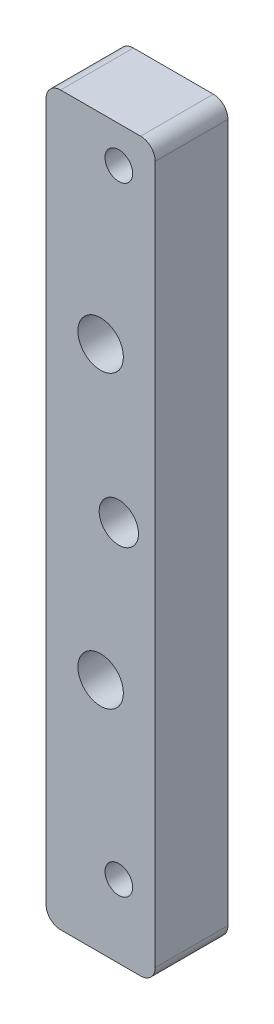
ISO-10303-21;
HEADER;
FILE_DESCRIPTION(('STEP AP214'),'2;1');
FILE_NAME('part.step','',(''),(''),'','','');
FILE_SCHEMA(('AUTOMOTIVE_DESIGN { 1 0 10303 214 1 1 1 1 }'));
ENDSEC;
DATA;
#1=APPLICATION_CONTEXT('core data for automotive mechanical design processes');
#2=APPLICATION_PROTOCOL_DEFINITION('international standard','automotive_design',2000,#1);
#3=PRODUCT_CONTEXT('',#1,'mechanical');
#4=PRODUCT('Part','Part','',(#3));
#5=PRODUCT_RELATED_PRODUCT_CATEGORY('part','',(#4));
#6=PRODUCT_DEFINITION_FORMATION('','',#4);
#7=PRODUCT_DEFINITION_CONTEXT('part definition',#1,'design');
#8=PRODUCT_DEFINITION('design','',#6,#7);
#9=PRODUCT_DEFINITION_SHAPE('','',#8);
#10=(LENGTH_UNIT() NAMED_UNIT(*) SI_UNIT(.MILLI.,.METRE.));
#11=(NAMED_UNIT(*) PLANE_ANGLE_UNIT() SI_UNIT($,.RADIAN.));
#12=(NAMED_UNIT(*) SI_UNIT($,.STERADIAN.) SOLID_ANGLE_UNIT());
#13=UNCERTAINTY_MEASURE_WITH_UNIT(LENGTH_MEASURE(1.E-05),#10,'distance_accuracy_value','');
#14=(GEOMETRIC_REPRESENTATION_CONTEXT(3) GLOBAL_UNCERTAINTY_ASSIGNED_CONTEXT((#13)) GLOBAL_UNIT_ASSIGNED_CONTEXT((#10,
#11,#12)) REPRESENTATION_CONTEXT('',''));
#15=CARTESIAN_POINT('',(0.,0.,0.));
#16=DIRECTION('',(0.,0.,1.));
#17=DIRECTION('',(1.,0.,0.));
#18=AXIS2_PLACEMENT_3D('',#15,#16,#17);
#19=CARTESIAN_POINT('',(-7.68933965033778,54.7924130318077,12.7));
#20=DIRECTION('',(1.,0.,0.));
#21=DIRECTION('',(0.,1.,0.));
#22=AXIS2_PLACEMENT_3D('',#19,#20,#21);
#23=PLANE('',#22);
#24=DIRECTION('',(0.,-1.,0.));
#25=VECTOR('',#24,1.);
#26=CARTESIAN_POINT('',(-7.68933965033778,54.7924130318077,0.));
#27=LINE('',#26,#25);
#28=CARTESIAN_POINT('',(-7.68933965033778,52.2524130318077,0.));
#29=VERTEX_POINT('',#28);
#30=CARTESIAN_POINT('',(-7.68933965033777,-69.6675869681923,0.));
#31=VERTEX_POINT('',#30);
#32=EDGE_CURVE('E140',#29,#31,#27,.T.);
#33=ORIENTED_EDGE('',*,*,#32,.T.);
#34=DIRECTION('',(0.,0.,-1.));
#35=VECTOR('',#34,1.);
#36=CARTESIAN_POINT('',(-7.68933965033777,-69.6675869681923,12.7));
#37=LINE('',#36,#35);
#38=CARTESIAN_POINT('',(-7.68933965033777,-69.6675869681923,12.7));
#39=VERTEX_POINT('',#38);
#40=EDGE_CURVE('E162',#31,#39,#37,.F.);
#41=ORIENTED_EDGE('',*,*,#40,.T.);
#42=DIRECTION('',(0.,-1.,0.));
#43=VECTOR('',#42,1.);
#44=CARTESIAN_POINT('',(-7.68933965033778,54.7924130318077,12.7));
#45=LINE('',#44,#43);
#46=CARTESIAN_POINT('',(-7.68933965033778,52.2524130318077,12.7));
#47=VERTEX_POINT('',#46);
#48=EDGE_CURVE('E138',#47,#39,#45,.T.);
#49=ORIENTED_EDGE('',*,*,#48,.F.);
#50=DIRECTION('',(0.,0.,-1.));
#51=VECTOR('',#50,1.);
#52=CARTESIAN_POINT('',(-7.68933965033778,52.2524130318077,12.7));
#53=LINE('',#52,#51);
#54=EDGE_CURVE('E159',#47,#29,#53,.T.);
#55=ORIENTED_EDGE('',*,*,#54,.T.);
#56=EDGE_LOOP('',(#33,#41,#49,#55));
#57=FACE_BOUND('',#56,.T.);
#58=ADVANCED_FACE('F43',(#57),#23,.F.);
#59=CARTESIAN_POINT('',(-7.68933965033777,-72.2075869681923,12.7));
#60=DIRECTION('',(0.,1.,0.));
#61=DIRECTION('',(0.,0.,1.));
#62=AXIS2_PLACEMENT_3D('',#59,#60,#61);
#63=PLANE('',#62);
#64=DIRECTION('',(1.,0.,0.));
#65=VECTOR('',#64,1.);
#66=CARTESIAN_POINT('',(-7.68933965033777,-72.2075869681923,0.));
#67=LINE('',#66,#65);
#68=CARTESIAN_POINT('',(-5.14933965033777,-72.2075869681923,0.));
#69=VERTEX_POINT('',#68);
#70=CARTESIAN_POINT('',(8.82066034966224,-72.2075869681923,0.));
#71=VERTEX_POINT('',#70);
#72=EDGE_CURVE('E136',#69,#71,#67,.T.);
#73=ORIENTED_EDGE('',*,*,#72,.T.);
#74=DIRECTION('',(0.,0.,-1.));
#75=VECTOR('',#74,1.);
#76=CARTESIAN_POINT('',(8.82066034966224,-72.2075869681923,12.7));
#77=LINE('',#76,#75);
#78=CARTESIAN_POINT('',(8.82066034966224,-72.2075869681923,12.7));
#79=VERTEX_POINT('',#78);
#80=EDGE_CURVE('E114',#71,#79,#77,.F.);
#81=ORIENTED_EDGE('',*,*,#80,.T.);
#82=DIRECTION('',(1.,0.,0.));
#83=VECTOR('',#82,1.);
#84=CARTESIAN_POINT('',(-7.68933965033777,-72.2075869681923,12.7));
#85=LINE('',#84,#83);
#86=CARTESIAN_POINT('',(-5.14933965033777,-72.2075869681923,12.7));
#87=VERTEX_POINT('',#86);
#88=EDGE_CURVE('E176',#87,#79,#85,.T.);
#89=ORIENTED_EDGE('',*,*,#88,.F.);
#90=DIRECTION('',(0.,0.,-1.));
#91=VECTOR('',#90,1.);
#92=CARTESIAN_POINT('',(-5.14933965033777,-72.2075869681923,12.7));
#93=LINE('',#92,#91);
#94=EDGE_CURVE('E119',#87,#69,#93,.T.);
#95=ORIENTED_EDGE('',*,*,#94,.T.);
#96=EDGE_LOOP('',(#73,#81,#89,#95));
#97=FACE_BOUND('',#96,.T.);
#98=ADVANCED_FACE('F181',(#97),#63,.F.);
#99=CARTESIAN_POINT('',(11.3606603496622,54.7924130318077,12.7));
#100=DIRECTION('',(-1.,0.,0.));
#101=DIRECTION('',(0.,-1.,0.));
#102=AXIS2_PLACEMENT_3D('',#99,#100,#101);
#103=PLANE('',#102);
#104=DIRECTION('',(0.,1.,0.));
#105=VECTOR('',#104,1.);
#106=CARTESIAN_POINT('',(11.3606603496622,54.7924130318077,12.7));
#107=LINE('',#106,#105);
#108=CARTESIAN_POINT('',(11.3606603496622,-69.6675869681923,12.7));
#109=VERTEX_POINT('',#108);
#110=CARTESIAN_POINT('',(11.3606603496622,52.2524130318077,12.7));
#111=VERTEX_POINT('',#110);
#112=EDGE_CURVE('E128',#109,#111,#107,.T.);
#113=ORIENTED_EDGE('',*,*,#112,.F.);
#114=DIRECTION('',(0.,0.,-1.));
#115=VECTOR('',#114,1.);
#116=CARTESIAN_POINT('',(11.3606603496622,-69.6675869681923,12.7));
#117=LINE('',#116,#115);
#118=CARTESIAN_POINT('',(11.3606603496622,-69.6675869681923,0.));
#119=VERTEX_POINT('',#118);
#120=EDGE_CURVE('E113',#109,#119,#117,.T.);
#121=ORIENTED_EDGE('',*,*,#120,.T.);
#122=DIRECTION('',(0.,1.,0.));
#123=VECTOR('',#122,1.);
#124=CARTESIAN_POINT('',(11.3606603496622,54.7924130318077,0.));
#125=LINE('',#124,#123);
#126=CARTESIAN_POINT('',(11.3606603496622,52.2524130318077,0.));
#127=VERTEX_POINT('',#126);
#128=EDGE_CURVE('E126',#119,#127,#125,.T.);
#129=ORIENTED_EDGE('',*,*,#128,.T.);
#130=DIRECTION('',(0.,0.,-1.));
#131=VECTOR('',#130,1.);
#132=CARTESIAN_POINT('',(11.3606603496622,52.2524130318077,12.7));
#133=LINE('',#132,#131);
#134=EDGE_CURVE('E130',#127,#111,#133,.F.);
#135=ORIENTED_EDGE('',*,*,#134,.T.);
#136=EDGE_LOOP('',(#113,#121,#129,#135));
#137=FACE_BOUND('',#136,.T.);
#138=ADVANCED_FACE('F125',(#137),#103,.F.);
#139=CARTESIAN_POINT('',(-7.68933965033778,54.7924130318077,12.7));
#140=DIRECTION('',(0.,-1.,0.));
#141=DIRECTION('',(0.,0.,-1.));
#142=AXIS2_PLACEMENT_3D('',#139,#140,#141);
#143=PLANE('',#142);
#144=DIRECTION('',(-1.,0.,0.));
#145=VECTOR('',#144,1.);
#146=CARTESIAN_POINT('',(-7.68933965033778,54.7924130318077,12.7));
#147=LINE('',#146,#145);
#148=CARTESIAN_POINT('',(8.82066034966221,54.7924130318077,12.7));
#149=VERTEX_POINT('',#148);
#150=CARTESIAN_POINT('',(-5.14933965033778,54.7924130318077,12.7));
#151=VERTEX_POINT('',#150);
#152=EDGE_CURVE('E144',#149,#151,#147,.T.);
#153=ORIENTED_EDGE('',*,*,#152,.F.);
#154=DIRECTION('',(0.,0.,-1.));
#155=VECTOR('',#154,1.);
#156=CARTESIAN_POINT('',(8.82066034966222,54.7924130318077,12.7));
#157=LINE('',#156,#155);
#158=CARTESIAN_POINT('',(8.82066034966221,54.7924130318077,0.));
#159=VERTEX_POINT('',#158);
#160=EDGE_CURVE('E13',#149,#159,#157,.T.);
#161=ORIENTED_EDGE('',*,*,#160,.T.);
#162=DIRECTION('',(-1.,0.,0.));
#163=VECTOR('',#162,1.);
#164=CARTESIAN_POINT('',(-7.68933965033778,54.7924130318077,0.));
#165=LINE('',#164,#163);
#166=CARTESIAN_POINT('',(-5.14933965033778,54.7924130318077,0.));
#167=VERTEX_POINT('',#166);
#168=EDGE_CURVE('E135',#159,#167,#165,.T.);
#169=ORIENTED_EDGE('',*,*,#168,.T.);
#170=DIRECTION('',(0.,0.,-1.));
#171=VECTOR('',#170,1.);
#172=CARTESIAN_POINT('',(-5.14933965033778,54.7924130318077,12.7));
#173=LINE('',#172,#171);
#174=EDGE_CURVE('E51',#167,#151,#173,.F.);
#175=ORIENTED_EDGE('',*,*,#174,.T.);
#176=EDGE_LOOP('',(#153,#161,#169,#175));
#177=FACE_BOUND('',#176,.T.);
#178=ADVANCED_FACE('F228',(#177),#143,.F.);
#179=CARTESIAN_POINT('',(-7.68933965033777,-72.2075869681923,12.7));
#180=DIRECTION('',(0.,0.,1.));
#181=DIRECTION('',(1.,0.,0.));
#182=AXIS2_PLACEMENT_3D('',#179,#180,#181);
#183=PLANE('',#182);
#184=CARTESIAN_POINT('',(1.83566034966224,-30.9325869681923,12.7));
#185=DIRECTION('',(0.,0.,1.));
#186=DIRECTION('',(1.,0.,0.));
#187=AXIS2_PLACEMENT_3D('',#184,#185,#186);
#188=CIRCLE('',#187,3.96875);
#189=CARTESIAN_POINT('',(5.80441034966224,-30.9325869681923,12.7));
#190=VERTEX_POINT('',#189);
#191=EDGE_CURVE('E211',#190,#190,#188,.T.);
#192=ORIENTED_EDGE('',*,*,#191,.F.);
#193=EDGE_LOOP('',(#192));
#194=FACE_BOUND('',#193,.T.);
#195=CARTESIAN_POINT('',(1.83566034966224,19.8674130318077,12.7));
#196=DIRECTION('',(0.,0.,1.));
#197=DIRECTION('',(1.,0.,0.));
#198=AXIS2_PLACEMENT_3D('',#195,#196,#197);
#199=CIRCLE('',#198,3.96875);
#200=CARTESIAN_POINT('',(5.80441034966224,19.8674130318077,12.7));
#201=VERTEX_POINT('',#200);
#202=EDGE_CURVE('E205',#201,#201,#199,.T.);
#203=ORIENTED_EDGE('',*,*,#202,.F.);
#204=EDGE_LOOP('',(#203));
#205=FACE_BOUND('',#204,.T.);
#206=CARTESIAN_POINT('',(5.01066034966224,-5.53258696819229,12.7));
#207=DIRECTION('',(0.,0.,1.));
#208=DIRECTION('',(1.,0.,0.));
#209=AXIS2_PLACEMENT_3D('',#206,#207,#208);
#210=CIRCLE('',#209,3.429);
#211=CARTESIAN_POINT('',(8.43966034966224,-5.53258696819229,12.7));
#212=VERTEX_POINT('',#211);
#213=EDGE_CURVE('E199',#212,#212,#210,.T.);
#214=ORIENTED_EDGE('',*,*,#213,.F.);
#215=EDGE_LOOP('',(#214));
#216=FACE_BOUND('',#215,.T.);
#217=CARTESIAN_POINT('',(5.01066034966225,-59.5075869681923,12.7));
#218=DIRECTION('',(0.,0.,1.));
#219=DIRECTION('',(1.,0.,0.));
#220=AXIS2_PLACEMENT_3D('',#217,#218,#219);
#221=CIRCLE('',#220,2.413);
#222=CARTESIAN_POINT('',(7.42366034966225,-59.5075869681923,12.7));
#223=VERTEX_POINT('',#222);
#224=EDGE_CURVE('E193',#223,#223,#221,.T.);
#225=ORIENTED_EDGE('',*,*,#224,.F.);
#226=EDGE_LOOP('',(#225));
#227=FACE_BOUND('',#226,.T.);
#228=CARTESIAN_POINT('',(5.01066034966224,48.4424130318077,12.7));
#229=DIRECTION('',(0.,0.,1.));
#230=DIRECTION('',(1.,0.,0.));
#231=AXIS2_PLACEMENT_3D('',#228,#229,#230);
#232=CIRCLE('',#231,2.413);
#233=CARTESIAN_POINT('',(7.42366034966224,48.4424130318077,12.7));
#234=VERTEX_POINT('',#233);
#235=EDGE_CURVE('E184',#234,#234,#232,.T.);
#236=ORIENTED_EDGE('',*,*,#235,.F.);
#237=EDGE_LOOP('',(#236));
#238=FACE_BOUND('',#237,.T.);
#239=ORIENTED_EDGE('',*,*,#88,.T.);
#240=CARTESIAN_POINT('',(8.82066034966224,-69.6675869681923,12.7));
#241=DIRECTION('',(0.,0.,1.));
#242=DIRECTION('',(1.,0.,0.));
#243=AXIS2_PLACEMENT_3D('',#240,#241,#242);
#244=CIRCLE('',#243,2.54);
#245=EDGE_CURVE('E157',#79,#109,#244,.T.);
#246=ORIENTED_EDGE('',*,*,#245,.T.);
#247=ORIENTED_EDGE('',*,*,#112,.T.);
#248=CARTESIAN_POINT('',(8.82066034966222,52.2524130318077,12.7));
#249=DIRECTION('',(0.,0.,1.));
#250=DIRECTION('',(1.,0.,0.));
#251=AXIS2_PLACEMENT_3D('',#248,#249,#250);
#252=CIRCLE('',#251,2.54);
#253=EDGE_CURVE('E64',#111,#149,#252,.T.);
#254=ORIENTED_EDGE('',*,*,#253,.T.);
#255=ORIENTED_EDGE('',*,*,#152,.T.);
#256=CARTESIAN_POINT('',(-5.14933965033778,52.2524130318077,12.7));
#257=DIRECTION('',(0.,0.,1.));
#258=DIRECTION('',(1.,0.,0.));
#259=AXIS2_PLACEMENT_3D('',#256,#257,#258);
#260=CIRCLE('',#259,2.54);
#261=EDGE_CURVE('E152',#151,#47,#260,.T.);
#262=ORIENTED_EDGE('',*,*,#261,.T.);
#263=ORIENTED_EDGE('',*,*,#48,.T.);
#264=CARTESIAN_POINT('',(-5.14933965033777,-69.6675869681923,12.7));
#265=DIRECTION('',(0.,0.,1.));
#266=DIRECTION('',(1.,0.,0.));
#267=AXIS2_PLACEMENT_3D('',#264,#265,#266);
#268=CIRCLE('',#267,2.54);
#269=EDGE_CURVE('E155',#39,#87,#268,.T.);
#270=ORIENTED_EDGE('',*,*,#269,.T.);
#271=EDGE_LOOP('',(#239,#246,#247,#254,#255,#262,#263,#270));
#272=FACE_BOUND('',#271,.T.);
#273=ADVANCED_FACE('F173',(#194,#205,#216,#227,#238,#272),#183,.T.);
#274=CARTESIAN_POINT('',(-7.68933965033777,-72.2075869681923,0.));
#275=DIRECTION('',(0.,0.,1.));
#276=DIRECTION('',(1.,0.,0.));
#277=AXIS2_PLACEMENT_3D('',#274,#275,#276);
#278=PLANE('',#277);
#279=CARTESIAN_POINT('',(1.83566034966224,-30.9325869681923,0.));
#280=DIRECTION('',(0.,0.,1.));
#281=DIRECTION('',(1.,0.,0.));
#282=AXIS2_PLACEMENT_3D('',#279,#280,#281);
#283=CIRCLE('',#282,3.96875);
#284=CARTESIAN_POINT('',(5.80441034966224,-30.9325869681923,0.));
#285=VERTEX_POINT('',#284);
#286=EDGE_CURVE('E208',#285,#285,#283,.T.);
#287=ORIENTED_EDGE('',*,*,#286,.T.);
#288=EDGE_LOOP('',(#287));
#289=FACE_BOUND('',#288,.T.);
#290=CARTESIAN_POINT('',(1.83566034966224,19.8674130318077,0.));
#291=DIRECTION('',(0.,0.,1.));
#292=DIRECTION('',(1.,0.,0.));
#293=AXIS2_PLACEMENT_3D('',#290,#291,#292);
#294=CIRCLE('',#293,3.96875);
#295=CARTESIAN_POINT('',(5.80441034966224,19.8674130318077,0.));
#296=VERTEX_POINT('',#295);
#297=EDGE_CURVE('E202',#296,#296,#294,.T.);
#298=ORIENTED_EDGE('',*,*,#297,.T.);
#299=EDGE_LOOP('',(#298));
#300=FACE_BOUND('',#299,.T.);
#301=CARTESIAN_POINT('',(5.01066034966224,-5.53258696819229,0.));
#302=DIRECTION('',(0.,0.,1.));
#303=DIRECTION('',(1.,0.,0.));
#304=AXIS2_PLACEMENT_3D('',#301,#302,#303);
#305=CIRCLE('',#304,3.429);
#306=CARTESIAN_POINT('',(8.43966034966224,-5.53258696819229,0.));
#307=VERTEX_POINT('',#306);
#308=EDGE_CURVE('E196',#307,#307,#305,.T.);
#309=ORIENTED_EDGE('',*,*,#308,.T.);
#310=EDGE_LOOP('',(#309));
#311=FACE_BOUND('',#310,.T.);
#312=CARTESIAN_POINT('',(5.01066034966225,-59.5075869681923,0.));
#313=DIRECTION('',(0.,0.,1.));
#314=DIRECTION('',(1.,0.,0.));
#315=AXIS2_PLACEMENT_3D('',#312,#313,#314);
#316=CIRCLE('',#315,2.413);
#317=CARTESIAN_POINT('',(7.42366034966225,-59.5075869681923,0.));
#318=VERTEX_POINT('',#317);
#319=EDGE_CURVE('E191',#318,#318,#316,.T.);
#320=ORIENTED_EDGE('',*,*,#319,.T.);
#321=EDGE_LOOP('',(#320));
#322=FACE_BOUND('',#321,.T.);
#323=CARTESIAN_POINT('',(5.01066034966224,48.4424130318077,0.));
#324=DIRECTION('',(0.,0.,1.));
#325=DIRECTION('',(1.,0.,0.));
#326=AXIS2_PLACEMENT_3D('',#323,#324,#325);
#327=CIRCLE('',#326,2.413);
#328=CARTESIAN_POINT('',(7.42366034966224,48.4424130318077,0.));
#329=VERTEX_POINT('',#328);
#330=EDGE_CURVE('E182',#329,#329,#327,.T.);
#331=ORIENTED_EDGE('',*,*,#330,.T.);
#332=EDGE_LOOP('',(#331));
#333=FACE_BOUND('',#332,.T.);
#334=ORIENTED_EDGE('',*,*,#128,.F.);
#335=CARTESIAN_POINT('',(8.82066034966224,-69.6675869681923,0.));
#336=DIRECTION('',(0.,0.,1.));
#337=DIRECTION('',(1.,0.,0.));
#338=AXIS2_PLACEMENT_3D('',#335,#336,#337);
#339=CIRCLE('',#338,2.54);
#340=EDGE_CURVE('E109',#119,#71,#339,.F.);
#341=ORIENTED_EDGE('',*,*,#340,.T.);
#342=ORIENTED_EDGE('',*,*,#72,.F.);
#343=CARTESIAN_POINT('',(-5.14933965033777,-69.6675869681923,0.));
#344=DIRECTION('',(0.,0.,1.));
#345=DIRECTION('',(1.,0.,0.));
#346=AXIS2_PLACEMENT_3D('',#343,#344,#345);
#347=CIRCLE('',#346,2.54);
#348=EDGE_CURVE('E120',#69,#31,#347,.F.);
#349=ORIENTED_EDGE('',*,*,#348,.T.);
#350=ORIENTED_EDGE('',*,*,#32,.F.);
#351=CARTESIAN_POINT('',(-5.14933965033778,52.2524130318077,0.));
#352=DIRECTION('',(0.,0.,1.));
#353=DIRECTION('',(1.,0.,0.));
#354=AXIS2_PLACEMENT_3D('',#351,#352,#353);
#355=CIRCLE('',#354,2.54);
#356=EDGE_CURVE('E129',#29,#167,#355,.F.);
#357=ORIENTED_EDGE('',*,*,#356,.T.);
#358=ORIENTED_EDGE('',*,*,#168,.F.);
#359=CARTESIAN_POINT('',(8.82066034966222,52.2524130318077,0.));
#360=DIRECTION('',(0.,0.,1.));
#361=DIRECTION('',(1.,0.,0.));
#362=AXIS2_PLACEMENT_3D('',#359,#360,#361);
#363=CIRCLE('',#362,2.54);
#364=EDGE_CURVE('E134',#159,#127,#363,.F.);
#365=ORIENTED_EDGE('',*,*,#364,.T.);
#366=EDGE_LOOP('',(#334,#341,#342,#349,#350,#357,#358,#365));
#367=FACE_BOUND('',#366,.T.);
#368=ADVANCED_FACE('F132',(#289,#300,#311,#322,#333,#367),#278,.F.);
#369=CARTESIAN_POINT('',(5.01066034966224,48.4424130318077,0.));
#370=DIRECTION('',(0.,0.,1.));
#371=DIRECTION('',(1.,0.,0.));
#372=AXIS2_PLACEMENT_3D('',#369,#370,#371);
#373=CYLINDRICAL_SURFACE('',#372,2.413);
#374=ORIENTED_EDGE('',*,*,#330,.F.);
#375=EDGE_LOOP('',(#374));
#376=FACE_BOUND('',#375,.T.);
#377=ORIENTED_EDGE('',*,*,#235,.T.);
#378=EDGE_LOOP('',(#377));
#379=FACE_BOUND('',#378,.T.);
#380=ADVANCED_FACE('F238',(#376,#379),#373,.F.);
#381=CARTESIAN_POINT('',(5.01066034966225,-59.5075869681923,0.));
#382=DIRECTION('',(0.,0.,1.));
#383=DIRECTION('',(1.,0.,0.));
#384=AXIS2_PLACEMENT_3D('',#381,#382,#383);
#385=CYLINDRICAL_SURFACE('',#384,2.413);
#386=ORIENTED_EDGE('',*,*,#319,.F.);
#387=EDGE_LOOP('',(#386));
#388=FACE_BOUND('',#387,.T.);
#389=ORIENTED_EDGE('',*,*,#224,.T.);
#390=EDGE_LOOP('',(#389));
#391=FACE_BOUND('',#390,.T.);
#392=ADVANCED_FACE('F240',(#388,#391),#385,.F.);
#393=CARTESIAN_POINT('',(5.01066034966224,-5.53258696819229,0.));
#394=DIRECTION('',(0.,0.,1.));
#395=DIRECTION('',(1.,0.,0.));
#396=AXIS2_PLACEMENT_3D('',#393,#394,#395);
#397=CYLINDRICAL_SURFACE('',#396,3.429);
#398=ORIENTED_EDGE('',*,*,#308,.F.);
#399=EDGE_LOOP('',(#398));
#400=FACE_BOUND('',#399,.T.);
#401=ORIENTED_EDGE('',*,*,#213,.T.);
#402=EDGE_LOOP('',(#401));
#403=FACE_BOUND('',#402,.T.);
#404=ADVANCED_FACE('F247',(#400,#403),#397,.F.);
#405=CARTESIAN_POINT('',(1.83566034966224,19.8674130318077,0.));
#406=DIRECTION('',(0.,0.,1.));
#407=DIRECTION('',(1.,0.,0.));
#408=AXIS2_PLACEMENT_3D('',#405,#406,#407);
#409=CYLINDRICAL_SURFACE('',#408,3.96875);
#410=ORIENTED_EDGE('',*,*,#297,.F.);
#411=EDGE_LOOP('',(#410));
#412=FACE_BOUND('',#411,.T.);
#413=ORIENTED_EDGE('',*,*,#202,.T.);
#414=EDGE_LOOP('',(#413));
#415=FACE_BOUND('',#414,.T.);
#416=ADVANCED_FACE('F222',(#412,#415),#409,.F.);
#417=CARTESIAN_POINT('',(1.83566034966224,-30.9325869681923,0.));
#418=DIRECTION('',(0.,0.,1.));
#419=DIRECTION('',(1.,0.,0.));
#420=AXIS2_PLACEMENT_3D('',#417,#418,#419);
#421=CYLINDRICAL_SURFACE('',#420,3.96875);
#422=ORIENTED_EDGE('',*,*,#286,.F.);
#423=EDGE_LOOP('',(#422));
#424=FACE_BOUND('',#423,.T.);
#425=ORIENTED_EDGE('',*,*,#191,.T.);
#426=EDGE_LOOP('',(#425));
#427=FACE_BOUND('',#426,.T.);
#428=ADVANCED_FACE('F219',(#424,#427),#421,.F.);
#429=CARTESIAN_POINT('',(8.82066034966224,-69.6675869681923,12.7));
#430=DIRECTION('',(0.,0.,-1.));
#431=DIRECTION('',(-1.,0.,0.));
#432=AXIS2_PLACEMENT_3D('',#429,#430,#431);
#433=CYLINDRICAL_SURFACE('',#432,2.54);
#434=ORIENTED_EDGE('',*,*,#245,.F.);
#435=ORIENTED_EDGE('',*,*,#80,.F.);
#436=ORIENTED_EDGE('',*,*,#340,.F.);
#437=ORIENTED_EDGE('',*,*,#120,.F.);
#438=EDGE_LOOP('',(#434,#435,#436,#437));
#439=FACE_BOUND('',#438,.T.);
#440=ADVANCED_FACE('F112',(#439),#433,.T.);
#441=CARTESIAN_POINT('',(-5.14933965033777,-69.6675869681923,12.7));
#442=DIRECTION('',(0.,0.,-1.));
#443=DIRECTION('',(-1.,0.,0.));
#444=AXIS2_PLACEMENT_3D('',#441,#442,#443);
#445=CYLINDRICAL_SURFACE('',#444,2.54);
#446=ORIENTED_EDGE('',*,*,#269,.F.);
#447=ORIENTED_EDGE('',*,*,#40,.F.);
#448=ORIENTED_EDGE('',*,*,#348,.F.);
#449=ORIENTED_EDGE('',*,*,#94,.F.);
#450=EDGE_LOOP('',(#446,#447,#448,#449));
#451=FACE_BOUND('',#450,.T.);
#452=ADVANCED_FACE('F179',(#451),#445,.T.);
#453=CARTESIAN_POINT('',(8.82066034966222,52.2524130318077,12.7));
#454=DIRECTION('',(0.,0.,-1.));
#455=DIRECTION('',(-1.,0.,0.));
#456=AXIS2_PLACEMENT_3D('',#453,#454,#455);
#457=CYLINDRICAL_SURFACE('',#456,2.54);
#458=ORIENTED_EDGE('',*,*,#253,.F.);
#459=ORIENTED_EDGE('',*,*,#134,.F.);
#460=ORIENTED_EDGE('',*,*,#364,.F.);
#461=ORIENTED_EDGE('',*,*,#160,.F.);
#462=EDGE_LOOP('',(#458,#459,#460,#461));
#463=FACE_BOUND('',#462,.T.);
#464=ADVANCED_FACE('F263',(#463),#457,.T.);
#465=CARTESIAN_POINT('',(-5.14933965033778,52.2524130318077,12.7));
#466=DIRECTION('',(0.,0.,-1.));
#467=DIRECTION('',(-1.,0.,0.));
#468=AXIS2_PLACEMENT_3D('',#465,#466,#467);
#469=CYLINDRICAL_SURFACE('',#468,2.54);
#470=ORIENTED_EDGE('',*,*,#261,.F.);
#471=ORIENTED_EDGE('',*,*,#174,.F.);
#472=ORIENTED_EDGE('',*,*,#356,.F.);
#473=ORIENTED_EDGE('',*,*,#54,.F.);
#474=EDGE_LOOP('',(#470,#471,#472,#473));
#475=FACE_BOUND('',#474,.T.);
#476=ADVANCED_FACE('F45',(#475),#469,.T.);
#477=CLOSED_SHELL('',(#58,#98,#138,#178,#273,#368,#380,#392,#404,#416,#428,#440,#452,#464,#476));
#478=MANIFOLD_SOLID_BREP('B2',#477);
#479=ADVANCED_BREP_SHAPE_REPRESENTATION('',(#18,#478),#14);
#480=SHAPE_DEFINITION_REPRESENTATION(#9,#479);
ENDSEC;
END-ISO-10303-21;
